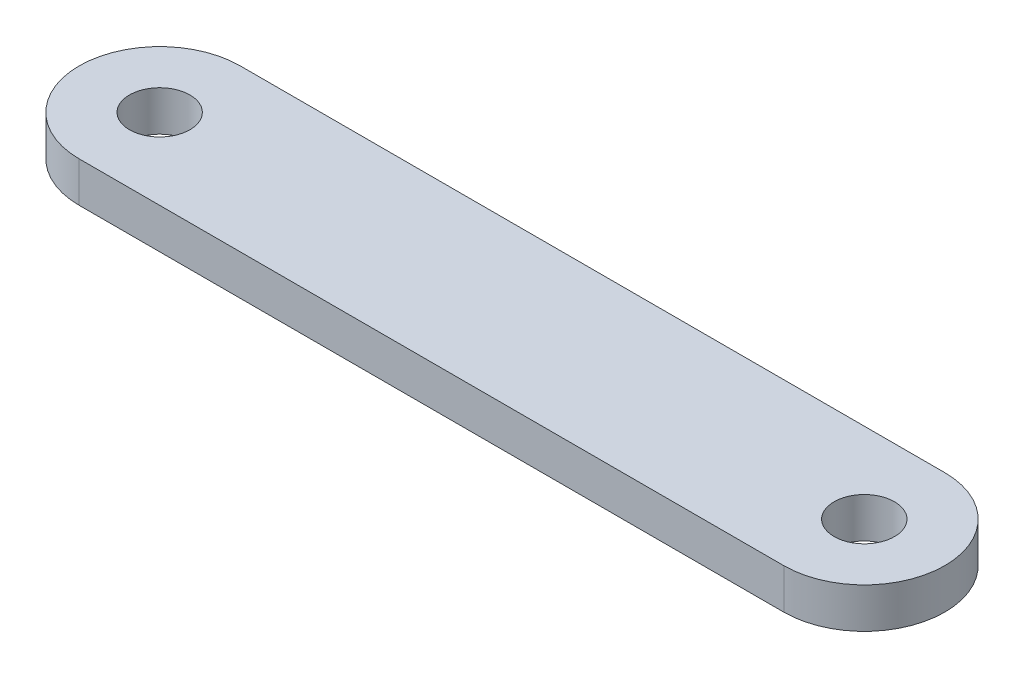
ISO-10303-21;
HEADER;
FILE_DESCRIPTION(('STEP AP214'),'2;1');
FILE_NAME('part.step','',(''),(''),'','','');
FILE_SCHEMA(('AUTOMOTIVE_DESIGN { 1 0 10303 214 1 1 1 1 }'));
ENDSEC;
DATA;
#1=APPLICATION_CONTEXT('core data for automotive mechanical design processes');
#2=APPLICATION_PROTOCOL_DEFINITION('international standard','automotive_design',2000,#1);
#3=PRODUCT_CONTEXT('',#1,'mechanical');
#4=PRODUCT('Part','Part','',(#3));
#5=PRODUCT_RELATED_PRODUCT_CATEGORY('part','',(#4));
#6=PRODUCT_DEFINITION_FORMATION('','',#4);
#7=PRODUCT_DEFINITION_CONTEXT('part definition',#1,'design');
#8=PRODUCT_DEFINITION('design','',#6,#7);
#9=PRODUCT_DEFINITION_SHAPE('','',#8);
#10=(LENGTH_UNIT() NAMED_UNIT(*) SI_UNIT(.MILLI.,.METRE.));
#11=(NAMED_UNIT(*) PLANE_ANGLE_UNIT() SI_UNIT($,.RADIAN.));
#12=(NAMED_UNIT(*) SI_UNIT($,.STERADIAN.) SOLID_ANGLE_UNIT());
#13=UNCERTAINTY_MEASURE_WITH_UNIT(LENGTH_MEASURE(1.E-05),#10,'distance_accuracy_value','');
#14=(GEOMETRIC_REPRESENTATION_CONTEXT(3) GLOBAL_UNCERTAINTY_ASSIGNED_CONTEXT((#13)) GLOBAL_UNIT_ASSIGNED_CONTEXT((#10,
#11,#12)) REPRESENTATION_CONTEXT('',''));
#15=CARTESIAN_POINT('',(0.,0.,0.));
#16=DIRECTION('',(0.,0.,1.));
#17=DIRECTION('',(1.,0.,0.));
#18=AXIS2_PLACEMENT_3D('',#15,#16,#17);
#19=CARTESIAN_POINT('',(0.,2.,0.));
#20=DIRECTION('',(0.,1.,0.));
#21=DIRECTION('',(0.,0.,1.));
#22=AXIS2_PLACEMENT_3D('',#19,#20,#21);
#23=PLANE('',#22);
#24=CARTESIAN_POINT('',(0.,2.,0.));
#25=DIRECTION('',(0.,1.,0.));
#26=DIRECTION('',(0.,0.,1.));
#27=AXIS2_PLACEMENT_3D('',#24,#25,#26);
#28=CIRCLE('',#27,1.5);
#29=CARTESIAN_POINT('',(0.,2.,1.5));
#30=VERTEX_POINT('',#29);
#31=EDGE_CURVE('E100',#30,#30,#28,.T.);
#32=ORIENTED_EDGE('',*,*,#31,.F.);
#33=EDGE_LOOP('',(#32));
#34=FACE_BOUND('',#33,.T.);
#35=CARTESIAN_POINT('',(0.,2.,0.));
#36=DIRECTION('',(0.,1.,0.));
#37=DIRECTION('',(0.,0.,1.));
#38=AXIS2_PLACEMENT_3D('',#35,#36,#37);
#39=CIRCLE('',#38,4.);
#40=CARTESIAN_POINT('',(0.,2.,-4.));
#41=VERTEX_POINT('',#40);
#42=CARTESIAN_POINT('',(0.,2.,4.));
#43=VERTEX_POINT('',#42);
#44=EDGE_CURVE('E85',#41,#43,#39,.T.);
#45=ORIENTED_EDGE('',*,*,#44,.T.);
#46=DIRECTION('',(1.,0.,0.));
#47=VECTOR('',#46,1.);
#48=CARTESIAN_POINT('',(0.,2.,4.));
#49=LINE('',#48,#47);
#50=CARTESIAN_POINT('',(35.,2.,4.));
#51=VERTEX_POINT('',#50);
#52=EDGE_CURVE('E80',#43,#51,#49,.T.);
#53=ORIENTED_EDGE('',*,*,#52,.T.);
#54=CARTESIAN_POINT('',(35.,2.,0.));
#55=DIRECTION('',(0.,1.,0.));
#56=DIRECTION('',(0.,0.,1.));
#57=AXIS2_PLACEMENT_3D('',#54,#55,#56);
#58=CIRCLE('',#57,4.);
#59=CARTESIAN_POINT('',(35.,2.,-4.));
#60=VERTEX_POINT('',#59);
#61=EDGE_CURVE('E83',#51,#60,#58,.T.);
#62=ORIENTED_EDGE('',*,*,#61,.T.);
#63=DIRECTION('',(-1.,0.,0.));
#64=VECTOR('',#63,1.);
#65=CARTESIAN_POINT('',(0.,2.,-4.));
#66=LINE('',#65,#64);
#67=EDGE_CURVE('E50',#60,#41,#66,.T.);
#68=ORIENTED_EDGE('',*,*,#67,.T.);
#69=EDGE_LOOP('',(#45,#53,#62,#68));
#70=FACE_BOUND('',#69,.T.);
#71=CARTESIAN_POINT('',(35.,2.,0.));
#72=DIRECTION('',(0.,1.,0.));
#73=DIRECTION('',(0.,0.,1.));
#74=AXIS2_PLACEMENT_3D('',#71,#72,#73);
#75=CIRCLE('',#74,1.5);
#76=CARTESIAN_POINT('',(35.,2.,1.5));
#77=VERTEX_POINT('',#76);
#78=EDGE_CURVE('E115',#77,#77,#75,.T.);
#79=ORIENTED_EDGE('',*,*,#78,.F.);
#80=EDGE_LOOP('',(#79));
#81=FACE_BOUND('',#80,.T.);
#82=ADVANCED_FACE('F33',(#34,#70,#81),#23,.T.);
#83=CARTESIAN_POINT('',(0.,0.,0.));
#84=DIRECTION('',(0.,1.,0.));
#85=DIRECTION('',(0.,0.,1.));
#86=AXIS2_PLACEMENT_3D('',#83,#84,#85);
#87=PLANE('',#86);
#88=CARTESIAN_POINT('',(0.,0.,0.));
#89=DIRECTION('',(0.,1.,0.));
#90=DIRECTION('',(0.,0.,1.));
#91=AXIS2_PLACEMENT_3D('',#88,#89,#90);
#92=CIRCLE('',#91,4.);
#93=CARTESIAN_POINT('',(0.,0.,-4.));
#94=VERTEX_POINT('',#93);
#95=CARTESIAN_POINT('',(0.,0.,4.));
#96=VERTEX_POINT('',#95);
#97=EDGE_CURVE('E97',#94,#96,#92,.T.);
#98=ORIENTED_EDGE('',*,*,#97,.F.);
#99=DIRECTION('',(-1.,0.,0.));
#100=VECTOR('',#99,1.);
#101=CARTESIAN_POINT('',(0.,0.,-4.));
#102=LINE('',#101,#100);
#103=CARTESIAN_POINT('',(35.,0.,-4.));
#104=VERTEX_POINT('',#103);
#105=EDGE_CURVE('E73',#104,#94,#102,.T.);
#106=ORIENTED_EDGE('',*,*,#105,.F.);
#107=CARTESIAN_POINT('',(35.,0.,0.));
#108=DIRECTION('',(0.,1.,0.));
#109=DIRECTION('',(0.,0.,1.));
#110=AXIS2_PLACEMENT_3D('',#107,#108,#109);
#111=CIRCLE('',#110,4.);
#112=CARTESIAN_POINT('',(35.,0.,4.));
#113=VERTEX_POINT('',#112);
#114=EDGE_CURVE('E67',#113,#104,#111,.T.);
#115=ORIENTED_EDGE('',*,*,#114,.F.);
#116=DIRECTION('',(1.,0.,0.));
#117=VECTOR('',#116,1.);
#118=CARTESIAN_POINT('',(0.,0.,4.));
#119=LINE('',#118,#117);
#120=EDGE_CURVE('E89',#96,#113,#119,.T.);
#121=ORIENTED_EDGE('',*,*,#120,.F.);
#122=EDGE_LOOP('',(#98,#106,#115,#121));
#123=FACE_BOUND('',#122,.T.);
#124=CARTESIAN_POINT('',(0.,0.,0.));
#125=DIRECTION('',(0.,1.,0.));
#126=DIRECTION('',(0.,0.,1.));
#127=AXIS2_PLACEMENT_3D('',#124,#125,#126);
#128=CIRCLE('',#127,1.5);
#129=CARTESIAN_POINT('',(0.,0.,1.5));
#130=VERTEX_POINT('',#129);
#131=EDGE_CURVE('E112',#130,#130,#128,.T.);
#132=ORIENTED_EDGE('',*,*,#131,.T.);
#133=EDGE_LOOP('',(#132));
#134=FACE_BOUND('',#133,.T.);
#135=CARTESIAN_POINT('',(35.,0.,0.));
#136=DIRECTION('',(0.,1.,0.));
#137=DIRECTION('',(0.,0.,1.));
#138=AXIS2_PLACEMENT_3D('',#135,#136,#137);
#139=CIRCLE('',#138,1.5);
#140=CARTESIAN_POINT('',(35.,0.,1.5));
#141=VERTEX_POINT('',#140);
#142=EDGE_CURVE('E118',#141,#141,#139,.T.);
#143=ORIENTED_EDGE('',*,*,#142,.T.);
#144=EDGE_LOOP('',(#143));
#145=FACE_BOUND('',#144,.T.);
#146=ADVANCED_FACE('F108',(#123,#134,#145),#87,.F.);
#147=CARTESIAN_POINT('',(0.,2.,0.));
#148=DIRECTION('',(0.,-1.,0.));
#149=DIRECTION('',(0.,0.,-1.));
#150=AXIS2_PLACEMENT_3D('',#147,#148,#149);
#151=CYLINDRICAL_SURFACE('',#150,4.);
#152=ORIENTED_EDGE('',*,*,#97,.T.);
#153=DIRECTION('',(0.,-1.,0.));
#154=VECTOR('',#153,1.);
#155=CARTESIAN_POINT('',(0.,2.,4.));
#156=LINE('',#155,#154);
#157=EDGE_CURVE('E11',#43,#96,#156,.T.);
#158=ORIENTED_EDGE('',*,*,#157,.F.);
#159=ORIENTED_EDGE('',*,*,#44,.F.);
#160=DIRECTION('',(0.,-1.,0.));
#161=VECTOR('',#160,1.);
#162=CARTESIAN_POINT('',(0.,2.,-4.));
#163=LINE('',#162,#161);
#164=EDGE_CURVE('E93',#41,#94,#163,.T.);
#165=ORIENTED_EDGE('',*,*,#164,.T.);
#166=EDGE_LOOP('',(#152,#158,#159,#165));
#167=FACE_BOUND('',#166,.T.);
#168=ADVANCED_FACE('F35',(#167),#151,.T.);
#169=CARTESIAN_POINT('',(0.,2.,4.));
#170=DIRECTION('',(0.,0.,-1.));
#171=DIRECTION('',(-1.,0.,0.));
#172=AXIS2_PLACEMENT_3D('',#169,#170,#171);
#173=PLANE('',#172);
#174=ORIENTED_EDGE('',*,*,#120,.T.);
#175=DIRECTION('',(0.,-1.,0.));
#176=VECTOR('',#175,1.);
#177=CARTESIAN_POINT('',(35.,2.,4.));
#178=LINE('',#177,#176);
#179=EDGE_CURVE('E42',#51,#113,#178,.T.);
#180=ORIENTED_EDGE('',*,*,#179,.F.);
#181=ORIENTED_EDGE('',*,*,#52,.F.);
#182=ORIENTED_EDGE('',*,*,#157,.T.);
#183=EDGE_LOOP('',(#174,#180,#181,#182));
#184=FACE_BOUND('',#183,.T.);
#185=ADVANCED_FACE('F88',(#184),#173,.F.);
#186=CARTESIAN_POINT('',(35.,2.,0.));
#187=DIRECTION('',(0.,-1.,0.));
#188=DIRECTION('',(0.,0.,-1.));
#189=AXIS2_PLACEMENT_3D('',#186,#187,#188);
#190=CYLINDRICAL_SURFACE('',#189,4.);
#191=ORIENTED_EDGE('',*,*,#114,.T.);
#192=DIRECTION('',(0.,-1.,0.));
#193=VECTOR('',#192,1.);
#194=CARTESIAN_POINT('',(35.,2.,-4.));
#195=LINE('',#194,#193);
#196=EDGE_CURVE('E90',#60,#104,#195,.T.);
#197=ORIENTED_EDGE('',*,*,#196,.F.);
#198=ORIENTED_EDGE('',*,*,#61,.F.);
#199=ORIENTED_EDGE('',*,*,#179,.T.);
#200=EDGE_LOOP('',(#191,#197,#198,#199));
#201=FACE_BOUND('',#200,.T.);
#202=ADVANCED_FACE('F91',(#201),#190,.T.);
#203=CARTESIAN_POINT('',(0.,2.,-4.));
#204=DIRECTION('',(0.,0.,1.));
#205=DIRECTION('',(1.,0.,0.));
#206=AXIS2_PLACEMENT_3D('',#203,#204,#205);
#207=PLANE('',#206);
#208=ORIENTED_EDGE('',*,*,#105,.T.);
#209=ORIENTED_EDGE('',*,*,#164,.F.);
#210=ORIENTED_EDGE('',*,*,#67,.F.);
#211=ORIENTED_EDGE('',*,*,#196,.T.);
#212=EDGE_LOOP('',(#208,#209,#210,#211));
#213=FACE_BOUND('',#212,.T.);
#214=ADVANCED_FACE('F105',(#213),#207,.F.);
#215=CARTESIAN_POINT('',(0.,2.,0.));
#216=DIRECTION('',(0.,-1.,0.));
#217=DIRECTION('',(0.,0.,-1.));
#218=AXIS2_PLACEMENT_3D('',#215,#216,#217);
#219=CYLINDRICAL_SURFACE('',#218,1.5);
#220=ORIENTED_EDGE('',*,*,#31,.T.);
#221=EDGE_LOOP('',(#220));
#222=FACE_BOUND('',#221,.T.);
#223=ORIENTED_EDGE('',*,*,#131,.F.);
#224=EDGE_LOOP('',(#223));
#225=FACE_BOUND('',#224,.T.);
#226=ADVANCED_FACE('F135',(#222,#225),#219,.F.);
#227=CARTESIAN_POINT('',(35.,2.,0.));
#228=DIRECTION('',(0.,-1.,0.));
#229=DIRECTION('',(0.,0.,-1.));
#230=AXIS2_PLACEMENT_3D('',#227,#228,#229);
#231=CYLINDRICAL_SURFACE('',#230,1.5);
#232=ORIENTED_EDGE('',*,*,#78,.T.);
#233=EDGE_LOOP('',(#232));
#234=FACE_BOUND('',#233,.T.);
#235=ORIENTED_EDGE('',*,*,#142,.F.);
#236=EDGE_LOOP('',(#235));
#237=FACE_BOUND('',#236,.T.);
#238=ADVANCED_FACE('F124',(#234,#237),#231,.F.);
#239=CLOSED_SHELL('',(#82,#146,#168,#185,#202,#214,#226,#238));
#240=MANIFOLD_SOLID_BREP('B2',#239);
#241=ADVANCED_BREP_SHAPE_REPRESENTATION('',(#18,#240),#14);
#242=SHAPE_DEFINITION_REPRESENTATION(#9,#241);
ENDSEC;
END-ISO-10303-21;
